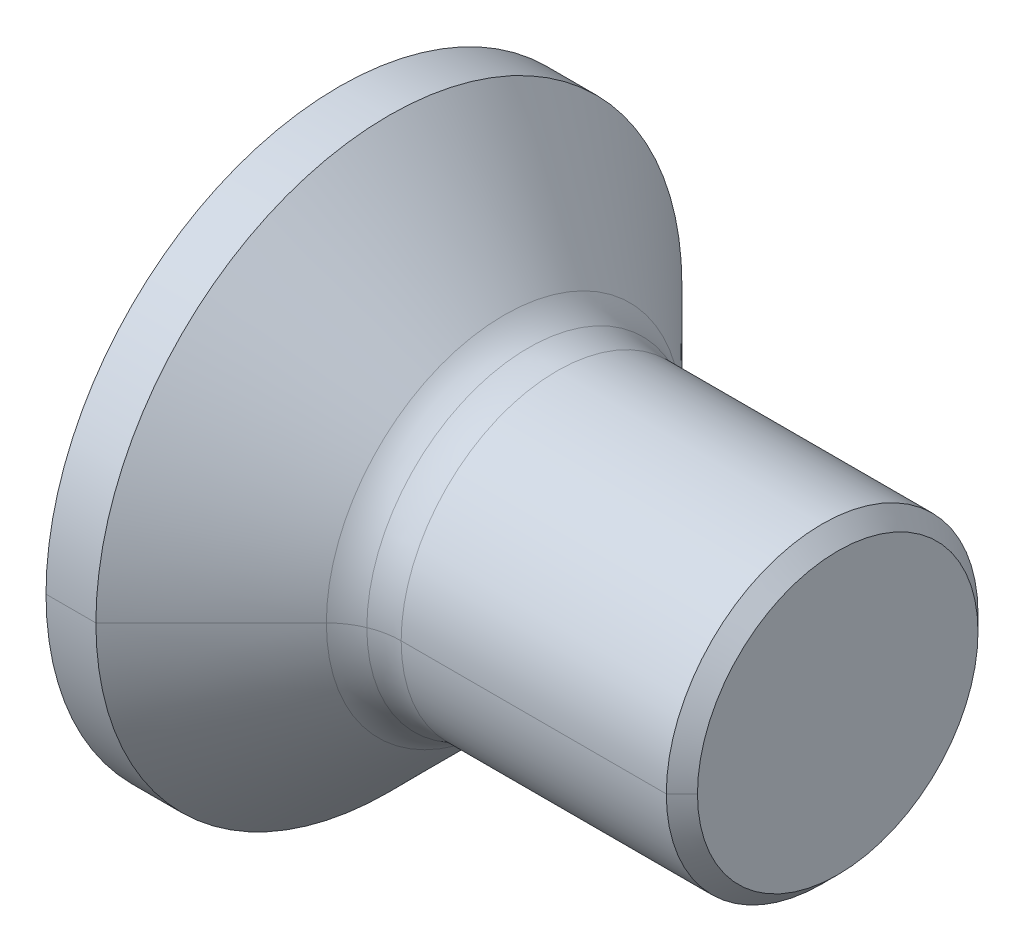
ISO-10303-21;
HEADER;
FILE_DESCRIPTION(('STEP AP214'),'2;1');
FILE_NAME('part.step','',(''),(''),'','','');
FILE_SCHEMA(('AUTOMOTIVE_DESIGN { 1 0 10303 214 1 1 1 1 }'));
ENDSEC;
DATA;
#1=APPLICATION_CONTEXT('core data for automotive mechanical design processes');
#2=APPLICATION_PROTOCOL_DEFINITION('international standard','automotive_design',2000,#1);
#3=PRODUCT_CONTEXT('',#1,'mechanical');
#4=PRODUCT('Part','Part','',(#3));
#5=PRODUCT_RELATED_PRODUCT_CATEGORY('part','',(#4));
#6=PRODUCT_DEFINITION_FORMATION('','',#4);
#7=PRODUCT_DEFINITION_CONTEXT('part definition',#1,'design');
#8=PRODUCT_DEFINITION('design','',#6,#7);
#9=PRODUCT_DEFINITION_SHAPE('','',#8);
#10=(LENGTH_UNIT() NAMED_UNIT(*) SI_UNIT(.MILLI.,.METRE.));
#11=(NAMED_UNIT(*) PLANE_ANGLE_UNIT() SI_UNIT($,.RADIAN.));
#12=(NAMED_UNIT(*) SI_UNIT($,.STERADIAN.) SOLID_ANGLE_UNIT());
#13=UNCERTAINTY_MEASURE_WITH_UNIT(LENGTH_MEASURE(1.E-05),#10,'distance_accuracy_value','');
#14=(GEOMETRIC_REPRESENTATION_CONTEXT(3) GLOBAL_UNCERTAINTY_ASSIGNED_CONTEXT((#13)) GLOBAL_UNIT_ASSIGNED_CONTEXT((#10,
#11,#12)) REPRESENTATION_CONTEXT('',''));
#15=CARTESIAN_POINT('',(0.,0.,0.));
#16=DIRECTION('',(0.,0.,1.));
#17=DIRECTION('',(1.,0.,0.));
#18=AXIS2_PLACEMENT_3D('',#15,#16,#17);
#19=CARTESIAN_POINT('',(0.75,0.37037037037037,1.5));
#20=DIRECTION('',(0.6,0.,0.8));
#21=DIRECTION('',(-0.8,0.,0.6));
#22=AXIS2_PLACEMENT_3D('',#19,#20,#21);
#23=PLANE('',#22);
#24=DIRECTION('',(0.,1.,0.));
#25=VECTOR('',#24,1.);
#26=CARTESIAN_POINT('',(0.75,-0.37037037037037,1.5));
#27=LINE('',#26,#25);
#28=CARTESIAN_POINT('',(0.75,-0.37037037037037,1.5));
#29=VERTEX_POINT('',#28);
#30=CARTESIAN_POINT('',(0.75,0.37037037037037,1.5));
#31=VERTEX_POINT('',#30);
#32=EDGE_CURVE('E20',#29,#31,#27,.T.);
#33=ORIENTED_EDGE('',*,*,#32,.T.);
#34=DIRECTION('',(-0.8,0.,0.6));
#35=VECTOR('',#34,1.);
#36=CARTESIAN_POINT('',(2.25,0.37037037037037,0.375));
#37=LINE('',#36,#35);
#38=CARTESIAN_POINT('',(2.25,0.37037037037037,0.375));
#39=VERTEX_POINT('',#38);
#40=EDGE_CURVE('E430',#39,#31,#37,.T.);
#41=ORIENTED_EDGE('',*,*,#40,.F.);
#42=DIRECTION('',(0.,-1.,0.));
#43=VECTOR('',#42,1.);
#44=CARTESIAN_POINT('',(2.25,0.37037037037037,0.375));
#45=LINE('',#44,#43);
#46=CARTESIAN_POINT('',(2.25,-0.37037037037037,0.375));
#47=VERTEX_POINT('',#46);
#48=EDGE_CURVE('E11',#39,#47,#45,.T.);
#49=ORIENTED_EDGE('',*,*,#48,.T.);
#50=DIRECTION('',(0.8,0.,-0.6));
#51=VECTOR('',#50,1.);
#52=CARTESIAN_POINT('',(0.75,-0.37037037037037,1.5));
#53=LINE('',#52,#51);
#54=EDGE_CURVE('E326',#29,#47,#53,.T.);
#55=ORIENTED_EDGE('',*,*,#54,.F.);
#56=EDGE_LOOP('',(#33,#41,#49,#55));
#57=FACE_BOUND('',#56,.T.);
#58=ADVANCED_FACE('F17',(#57),#23,.F.);
#59=CARTESIAN_POINT('',(2.25,0.37037037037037,0.375));
#60=DIRECTION('',(1.,0.,0.));
#61=DIRECTION('',(0.,0.,1.));
#62=AXIS2_PLACEMENT_3D('',#59,#60,#61);
#63=PLANE('',#62);
#64=ORIENTED_EDGE('',*,*,#48,.F.);
#65=DIRECTION('',(0.,0.,1.));
#66=VECTOR('',#65,1.);
#67=CARTESIAN_POINT('',(2.25,0.37037037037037,-0.375));
#68=LINE('',#67,#66);
#69=CARTESIAN_POINT('',(2.25,0.37037037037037,-0.375));
#70=VERTEX_POINT('',#69);
#71=EDGE_CURVE('E418',#70,#39,#68,.T.);
#72=ORIENTED_EDGE('',*,*,#71,.F.);
#73=DIRECTION('',(0.,-1.,0.));
#74=VECTOR('',#73,1.);
#75=CARTESIAN_POINT('',(2.25,0.37037037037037,-0.375));
#76=LINE('',#75,#74);
#77=CARTESIAN_POINT('',(2.25,-0.37037037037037,-0.375));
#78=VERTEX_POINT('',#77);
#79=EDGE_CURVE('E25',#70,#78,#76,.T.);
#80=ORIENTED_EDGE('',*,*,#79,.T.);
#81=DIRECTION('',(0.,0.,1.));
#82=VECTOR('',#81,1.);
#83=CARTESIAN_POINT('',(2.25,-0.37037037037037,-0.375));
#84=LINE('',#83,#82);
#85=EDGE_CURVE('E324',#78,#47,#84,.T.);
#86=ORIENTED_EDGE('',*,*,#85,.T.);
#87=EDGE_LOOP('',(#64,#72,#80,#86));
#88=FACE_BOUND('',#87,.T.);
#89=ADVANCED_FACE('F415',(#88),#63,.F.);
#90=CARTESIAN_POINT('',(2.25,0.37037037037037,-0.375));
#91=DIRECTION('',(0.6,0.,-0.8));
#92=DIRECTION('',(0.8,0.,0.6));
#93=AXIS2_PLACEMENT_3D('',#90,#91,#92);
#94=PLANE('',#93);
#95=ORIENTED_EDGE('',*,*,#79,.F.);
#96=DIRECTION('',(0.8,0.,0.6));
#97=VECTOR('',#96,1.);
#98=CARTESIAN_POINT('',(0.75,0.37037037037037,-1.5));
#99=LINE('',#98,#97);
#100=CARTESIAN_POINT('',(0.75,0.37037037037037,-1.5));
#101=VERTEX_POINT('',#100);
#102=EDGE_CURVE('E435',#101,#70,#99,.T.);
#103=ORIENTED_EDGE('',*,*,#102,.F.);
#104=DIRECTION('',(0.,1.,0.));
#105=VECTOR('',#104,1.);
#106=CARTESIAN_POINT('',(0.75,-0.37037037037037,-1.5));
#107=LINE('',#106,#105);
#108=CARTESIAN_POINT('',(0.75,-0.37037037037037,-1.5));
#109=VERTEX_POINT('',#108);
#110=EDGE_CURVE('E402',#109,#101,#107,.T.);
#111=ORIENTED_EDGE('',*,*,#110,.F.);
#112=DIRECTION('',(-0.8,0.,-0.6));
#113=VECTOR('',#112,1.);
#114=CARTESIAN_POINT('',(2.25,-0.37037037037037,-0.375));
#115=LINE('',#114,#113);
#116=EDGE_CURVE('E321',#78,#109,#115,.T.);
#117=ORIENTED_EDGE('',*,*,#116,.F.);
#118=EDGE_LOOP('',(#95,#103,#111,#117));
#119=FACE_BOUND('',#118,.T.);
#120=ADVANCED_FACE('F421',(#119),#94,.F.);
#121=CARTESIAN_POINT('',(0.75,0.37037037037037,-1.5));
#122=DIRECTION('',(0.,0.,-1.));
#123=DIRECTION('',(1.,0.,0.));
#124=AXIS2_PLACEMENT_3D('',#121,#122,#123);
#125=PLANE('',#124);
#126=DIRECTION('',(1.,0.,0.));
#127=VECTOR('',#126,1.);
#128=CARTESIAN_POINT('',(0.,-0.37037037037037,-1.5));
#129=LINE('',#128,#127);
#130=CARTESIAN_POINT('',(0.,-0.37037037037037,-1.5));
#131=VERTEX_POINT('',#130);
#132=EDGE_CURVE('E325',#131,#109,#129,.T.);
#133=ORIENTED_EDGE('',*,*,#132,.T.);
#134=ORIENTED_EDGE('',*,*,#110,.T.);
#135=DIRECTION('',(1.,0.,0.));
#136=VECTOR('',#135,1.);
#137=CARTESIAN_POINT('',(0.,0.37037037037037,-1.5));
#138=LINE('',#137,#136);
#139=CARTESIAN_POINT('',(0.,0.37037037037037,-1.5));
#140=VERTEX_POINT('',#139);
#141=EDGE_CURVE('E281',#140,#101,#138,.T.);
#142=ORIENTED_EDGE('',*,*,#141,.F.);
#143=DIRECTION('',(0.,-1.,0.));
#144=VECTOR('',#143,1.);
#145=CARTESIAN_POINT('',(0.,0.37037037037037,-1.5));
#146=LINE('',#145,#144);
#147=EDGE_CURVE('E320',#140,#131,#146,.T.);
#148=ORIENTED_EDGE('',*,*,#147,.T.);
#149=EDGE_LOOP('',(#133,#134,#142,#148));
#150=FACE_BOUND('',#149,.T.);
#151=ADVANCED_FACE('F639',(#150),#125,.F.);
#152=CARTESIAN_POINT('',(0.75,-1.5,0.375));
#153=DIRECTION('',(0.603857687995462,-0.79709214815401,0.));
#154=DIRECTION('',(-0.79709214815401,-0.603857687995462,0.));
#155=AXIS2_PLACEMENT_3D('',#152,#153,#154);
#156=PLANE('',#155);
#157=DIRECTION('',(0.,0.,1.));
#158=VECTOR('',#157,1.);
#159=CARTESIAN_POINT('',(0.75,-1.5,-0.375));
#160=LINE('',#159,#158);
#161=CARTESIAN_POINT('',(0.75,-1.5,-0.375));
#162=VERTEX_POINT('',#161);
#163=CARTESIAN_POINT('',(0.75,-1.5,0.375));
#164=VERTEX_POINT('',#163);
#165=EDGE_CURVE('E396',#162,#164,#160,.T.);
#166=ORIENTED_EDGE('',*,*,#165,.T.);
#167=DIRECTION('',(-0.797092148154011,-0.603857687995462,0.));
#168=VECTOR('',#167,1.);
#169=CARTESIAN_POINT('',(2.235,-0.375,0.375));
#170=LINE('',#169,#168);
#171=CARTESIAN_POINT('',(2.235,-0.375,0.375));
#172=VERTEX_POINT('',#171);
#173=EDGE_CURVE('E376',#172,#164,#170,.T.);
#174=ORIENTED_EDGE('',*,*,#173,.F.);
#175=DIRECTION('',(0.,0.,-1.));
#176=VECTOR('',#175,1.);
#177=CARTESIAN_POINT('',(2.235,-0.375,0.375));
#178=LINE('',#177,#176);
#179=CARTESIAN_POINT('',(2.235,-0.375,-0.375));
#180=VERTEX_POINT('',#179);
#181=EDGE_CURVE('E383',#172,#180,#178,.T.);
#182=ORIENTED_EDGE('',*,*,#181,.T.);
#183=DIRECTION('',(0.797092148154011,0.603857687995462,0.));
#184=VECTOR('',#183,1.);
#185=CARTESIAN_POINT('',(0.75,-1.5,-0.375));
#186=LINE('',#185,#184);
#187=EDGE_CURVE('E356',#162,#180,#186,.T.);
#188=ORIENTED_EDGE('',*,*,#187,.F.);
#189=EDGE_LOOP('',(#166,#174,#182,#188));
#190=FACE_BOUND('',#189,.T.);
#191=ADVANCED_FACE('F644',(#190),#156,.F.);
#192=CARTESIAN_POINT('',(-1.,-1.5,0.375));
#193=DIRECTION('',(0.,-1.,0.));
#194=DIRECTION('',(-1.,0.,0.));
#195=AXIS2_PLACEMENT_3D('',#192,#193,#194);
#196=PLANE('',#195);
#197=DIRECTION('',(-1.,0.,0.));
#198=VECTOR('',#197,1.);
#199=CARTESIAN_POINT('',(0.75,-1.5,0.375));
#200=LINE('',#199,#198);
#201=CARTESIAN_POINT('',(0.,-1.5,0.375));
#202=VERTEX_POINT('',#201);
#203=EDGE_CURVE('E373',#164,#202,#200,.T.);
#204=ORIENTED_EDGE('',*,*,#203,.F.);
#205=ORIENTED_EDGE('',*,*,#165,.F.);
#206=DIRECTION('',(1.,0.,0.));
#207=VECTOR('',#206,1.);
#208=CARTESIAN_POINT('',(0.,-1.5,-0.375));
#209=LINE('',#208,#207);
#210=CARTESIAN_POINT('',(0.,-1.5,-0.375));
#211=VERTEX_POINT('',#210);
#212=EDGE_CURVE('E359',#211,#162,#209,.T.);
#213=ORIENTED_EDGE('',*,*,#212,.F.);
#214=DIRECTION('',(0.,0.,-1.));
#215=VECTOR('',#214,1.);
#216=CARTESIAN_POINT('',(0.,-1.5,0.375));
#217=LINE('',#216,#215);
#218=EDGE_CURVE('E372',#202,#211,#217,.T.);
#219=ORIENTED_EDGE('',*,*,#218,.F.);
#220=EDGE_LOOP('',(#204,#205,#213,#219));
#221=FACE_BOUND('',#220,.T.);
#222=ADVANCED_FACE('F648',(#221),#196,.F.);
#223=CARTESIAN_POINT('',(0.,-1.06066017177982,1.06066017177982));
#224=DIRECTION('',(0.,0.642787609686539,0.766044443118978));
#225=DIRECTION('',(0.,-0.766044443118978,0.642787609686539));
#226=AXIS2_PLACEMENT_3D('',#223,#224,#225);
#227=PLANE('',#226);
#228=DIRECTION('',(0.,0.766044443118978,-0.642787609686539));
#229=VECTOR('',#228,1.);
#230=CARTESIAN_POINT('',(1.,-1.06066017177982,1.06066017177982));
#231=LINE('',#230,#229);
#232=CARTESIAN_POINT('',(1.,-1.06066017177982,1.06066017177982));
#233=VERTEX_POINT('',#232);
#234=CARTESIAN_POINT('',(1.,-0.37037037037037,0.481438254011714));
#235=VERTEX_POINT('',#234);
#236=EDGE_CURVE('E390',#233,#235,#231,.T.);
#237=ORIENTED_EDGE('',*,*,#236,.F.);
#238=DIRECTION('',(1.,0.,0.));
#239=VECTOR('',#238,1.);
#240=CARTESIAN_POINT('',(0.,-1.06066017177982,1.06066017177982));
#241=LINE('',#240,#239);
#242=CARTESIAN_POINT('',(0.,-1.06066017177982,1.06066017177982));
#243=VERTEX_POINT('',#242);
#244=EDGE_CURVE('E387',#243,#233,#241,.T.);
#245=ORIENTED_EDGE('',*,*,#244,.F.);
#246=DIRECTION('',(0.,-0.766044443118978,0.642787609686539));
#247=VECTOR('',#246,1.);
#248=CARTESIAN_POINT('',(0.,-0.370370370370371,0.481438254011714));
#249=LINE('',#248,#247);
#250=CARTESIAN_POINT('',(0.,-0.37037037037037,0.481438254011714));
#251=VERTEX_POINT('',#250);
#252=EDGE_CURVE('E331',#251,#243,#249,.T.);
#253=ORIENTED_EDGE('',*,*,#252,.F.);
#254=DIRECTION('',(1.,0.,0.));
#255=VECTOR('',#254,1.);
#256=CARTESIAN_POINT('',(0.,-0.37037037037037,0.481438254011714));
#257=LINE('',#256,#255);
#258=EDGE_CURVE('E329',#251,#235,#257,.T.);
#259=ORIENTED_EDGE('',*,*,#258,.T.);
#260=EDGE_LOOP('',(#237,#245,#253,#259));
#261=FACE_BOUND('',#260,.T.);
#262=ADVANCED_FACE('F606',(#261),#227,.F.);
#263=CARTESIAN_POINT('',(1.,0.,0.));
#264=DIRECTION('',(-1.,0.,0.));
#265=DIRECTION('',(0.,0.,1.));
#266=AXIS2_PLACEMENT_3D('',#263,#264,#265);
#267=PLANE('',#266);
#268=DIRECTION('',(0.,-0.642787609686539,0.766044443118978));
#269=VECTOR('',#268,1.);
#270=CARTESIAN_POINT('',(1.,-0.485322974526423,0.375));
#271=LINE('',#270,#269);
#272=CARTESIAN_POINT('',(1.,-0.485322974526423,0.375));
#273=VERTEX_POINT('',#272);
#274=EDGE_CURVE('E391',#273,#233,#271,.T.);
#275=ORIENTED_EDGE('',*,*,#274,.T.);
#276=ORIENTED_EDGE('',*,*,#236,.T.);
#277=DIRECTION('',(0.,0.,-1.));
#278=VECTOR('',#277,1.);
#279=CARTESIAN_POINT('',(1.,-0.37037037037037,0.481438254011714));
#280=LINE('',#279,#278);
#281=CARTESIAN_POINT('',(1.,-0.37037037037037,0.375));
#282=VERTEX_POINT('',#281);
#283=EDGE_CURVE('E385',#235,#282,#280,.T.);
#284=ORIENTED_EDGE('',*,*,#283,.T.);
#285=DIRECTION('',(0.,-1.,0.));
#286=VECTOR('',#285,1.);
#287=CARTESIAN_POINT('',(1.,-0.37037037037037,0.375));
#288=LINE('',#287,#286);
#289=EDGE_CURVE('E380',#282,#273,#288,.T.);
#290=ORIENTED_EDGE('',*,*,#289,.T.);
#291=EDGE_LOOP('',(#275,#276,#284,#290));
#292=FACE_BOUND('',#291,.T.);
#293=ADVANCED_FACE('F611',(#292),#267,.T.);
#294=CARTESIAN_POINT('',(0.,-0.170660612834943,0.));
#295=DIRECTION('',(0.,-0.766044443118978,-0.642787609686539));
#296=DIRECTION('',(0.,0.642787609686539,-0.766044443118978));
#297=AXIS2_PLACEMENT_3D('',#294,#295,#296);
#298=PLANE('',#297);
#299=DIRECTION('',(0.,0.642787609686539,-0.766044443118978));
#300=VECTOR('',#299,1.);
#301=CARTESIAN_POINT('',(0.,-1.06066017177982,1.06066017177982));
#302=LINE('',#301,#300);
#303=CARTESIAN_POINT('',(0.,-0.485322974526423,0.375));
#304=VERTEX_POINT('',#303);
#305=EDGE_CURVE('E371',#243,#304,#302,.T.);
#306=ORIENTED_EDGE('',*,*,#305,.F.);
#307=ORIENTED_EDGE('',*,*,#244,.T.);
#308=ORIENTED_EDGE('',*,*,#274,.F.);
#309=DIRECTION('',(-1.,0.,0.));
#310=VECTOR('',#309,1.);
#311=CARTESIAN_POINT('',(1.,-0.485322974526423,0.375));
#312=LINE('',#311,#310);
#313=EDGE_CURVE('E377',#273,#304,#312,.T.);
#314=ORIENTED_EDGE('',*,*,#313,.T.);
#315=EDGE_LOOP('',(#306,#307,#308,#314));
#316=FACE_BOUND('',#315,.T.);
#317=ADVANCED_FACE('F618',(#316),#298,.F.);
#318=CARTESIAN_POINT('',(0.,0.,0.375));
#319=DIRECTION('',(0.,0.,1.));
#320=DIRECTION('',(1.,0.,0.));
#321=AXIS2_PLACEMENT_3D('',#318,#319,#320);
#322=PLANE('',#321);
#323=ORIENTED_EDGE('',*,*,#289,.F.);
#324=DIRECTION('',(1.,0.,0.));
#325=VECTOR('',#324,1.);
#326=CARTESIAN_POINT('',(1.,-0.37037037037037,0.375));
#327=LINE('',#326,#325);
#328=CARTESIAN_POINT('',(2.235,-0.37037037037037,0.375));
#329=VERTEX_POINT('',#328);
#330=EDGE_CURVE('E336',#282,#329,#327,.T.);
#331=ORIENTED_EDGE('',*,*,#330,.T.);
#332=DIRECTION('',(0.,-1.,0.));
#333=VECTOR('',#332,1.);
#334=CARTESIAN_POINT('',(2.235,-0.37037037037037,0.375));
#335=LINE('',#334,#333);
#336=EDGE_CURVE('E366',#329,#172,#335,.T.);
#337=ORIENTED_EDGE('',*,*,#336,.T.);
#338=ORIENTED_EDGE('',*,*,#173,.T.);
#339=ORIENTED_EDGE('',*,*,#203,.T.);
#340=DIRECTION('',(0.,1.,0.));
#341=VECTOR('',#340,1.);
#342=CARTESIAN_POINT('',(0.,-1.5,0.375));
#343=LINE('',#342,#341);
#344=EDGE_CURVE('E368',#202,#304,#343,.T.);
#345=ORIENTED_EDGE('',*,*,#344,.T.);
#346=ORIENTED_EDGE('',*,*,#313,.F.);
#347=EDGE_LOOP('',(#323,#331,#337,#338,#339,#345,#346));
#348=FACE_BOUND('',#347,.T.);
#349=ADVANCED_FACE('F615',(#348),#322,.F.);
#350=CARTESIAN_POINT('',(2.235,-0.375,0.375));
#351=DIRECTION('',(1.,0.,0.));
#352=DIRECTION('',(0.,-1.,0.));
#353=AXIS2_PLACEMENT_3D('',#350,#351,#352);
#354=PLANE('',#353);
#355=DIRECTION('',(0.,1.,0.));
#356=VECTOR('',#355,1.);
#357=CARTESIAN_POINT('',(2.235,-0.375,-0.375));
#358=LINE('',#357,#356);
#359=CARTESIAN_POINT('',(2.235,-0.37037037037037,-0.375));
#360=VERTEX_POINT('',#359);
#361=EDGE_CURVE('E353',#180,#360,#358,.T.);
#362=ORIENTED_EDGE('',*,*,#361,.F.);
#363=ORIENTED_EDGE('',*,*,#181,.F.);
#364=ORIENTED_EDGE('',*,*,#336,.F.);
#365=DIRECTION('',(0.,0.,1.));
#366=VECTOR('',#365,1.);
#367=CARTESIAN_POINT('',(2.235,-0.37037037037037,-0.375));
#368=LINE('',#367,#366);
#369=EDGE_CURVE('E332',#360,#329,#368,.T.);
#370=ORIENTED_EDGE('',*,*,#369,.F.);
#371=EDGE_LOOP('',(#362,#363,#364,#370));
#372=FACE_BOUND('',#371,.T.);
#373=ADVANCED_FACE('F626',(#372),#354,.F.);
#374=CARTESIAN_POINT('',(0.,0.,-0.170660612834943));
#375=DIRECTION('',(0.,0.642787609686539,-0.766044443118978));
#376=DIRECTION('',(0.,0.766044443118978,0.642787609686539));
#377=AXIS2_PLACEMENT_3D('',#374,#375,#376);
#378=PLANE('',#377);
#379=DIRECTION('',(0.,0.766044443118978,0.642787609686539));
#380=VECTOR('',#379,1.);
#381=CARTESIAN_POINT('',(0.,-1.06066017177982,-1.06066017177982));
#382=LINE('',#381,#380);
#383=CARTESIAN_POINT('',(0.,-1.06066017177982,-1.06066017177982));
#384=VERTEX_POINT('',#383);
#385=CARTESIAN_POINT('',(0.,-0.37037037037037,-0.481438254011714));
#386=VERTEX_POINT('',#385);
#387=EDGE_CURVE('E319',#384,#386,#382,.T.);
#388=ORIENTED_EDGE('',*,*,#387,.F.);
#389=DIRECTION('',(-1.,0.,0.));
#390=VECTOR('',#389,1.);
#391=CARTESIAN_POINT('',(1.,-1.06066017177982,-1.06066017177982));
#392=LINE('',#391,#390);
#393=CARTESIAN_POINT('',(1.,-1.06066017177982,-1.06066017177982));
#394=VERTEX_POINT('',#393);
#395=EDGE_CURVE('E362',#394,#384,#392,.T.);
#396=ORIENTED_EDGE('',*,*,#395,.F.);
#397=DIRECTION('',(0.,-0.766044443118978,-0.642787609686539));
#398=VECTOR('',#397,1.);
#399=CARTESIAN_POINT('',(1.,-0.37037037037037,-0.481438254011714));
#400=LINE('',#399,#398);
#401=CARTESIAN_POINT('',(1.,-0.37037037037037,-0.481438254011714));
#402=VERTEX_POINT('',#401);
#403=EDGE_CURVE('E345',#402,#394,#400,.T.);
#404=ORIENTED_EDGE('',*,*,#403,.F.);
#405=DIRECTION('',(-1.,0.,0.));
#406=VECTOR('',#405,1.);
#407=CARTESIAN_POINT('',(1.,-0.37037037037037,-0.481438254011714));
#408=LINE('',#407,#406);
#409=EDGE_CURVE('E352',#402,#386,#408,.T.);
#410=ORIENTED_EDGE('',*,*,#409,.T.);
#411=EDGE_LOOP('',(#388,#396,#404,#410));
#412=FACE_BOUND('',#411,.T.);
#413=ADVANCED_FACE('F669',(#412),#378,.F.);
#414=CARTESIAN_POINT('',(0.,-1.06066017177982,-1.06066017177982));
#415=DIRECTION('',(0.,-0.766044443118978,0.642787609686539));
#416=DIRECTION('',(0.,-0.642787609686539,-0.766044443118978));
#417=AXIS2_PLACEMENT_3D('',#414,#415,#416);
#418=PLANE('',#417);
#419=DIRECTION('',(0.,0.642787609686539,0.766044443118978));
#420=VECTOR('',#419,1.);
#421=CARTESIAN_POINT('',(1.,-1.06066017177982,-1.06066017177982));
#422=LINE('',#421,#420);
#423=CARTESIAN_POINT('',(1.,-0.485322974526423,-0.375));
#424=VERTEX_POINT('',#423);
#425=EDGE_CURVE('E342',#394,#424,#422,.T.);
#426=ORIENTED_EDGE('',*,*,#425,.F.);
#427=ORIENTED_EDGE('',*,*,#395,.T.);
#428=DIRECTION('',(0.,-0.642787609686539,-0.766044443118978));
#429=VECTOR('',#428,1.);
#430=CARTESIAN_POINT('',(0.,-0.485322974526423,-0.375));
#431=LINE('',#430,#429);
#432=CARTESIAN_POINT('',(0.,-0.485322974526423,-0.375));
#433=VERTEX_POINT('',#432);
#434=EDGE_CURVE('E593',#433,#384,#431,.T.);
#435=ORIENTED_EDGE('',*,*,#434,.F.);
#436=DIRECTION('',(1.,0.,0.));
#437=VECTOR('',#436,1.);
#438=CARTESIAN_POINT('',(0.,-0.485322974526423,-0.375));
#439=LINE('',#438,#437);
#440=EDGE_CURVE('E348',#433,#424,#439,.T.);
#441=ORIENTED_EDGE('',*,*,#440,.T.);
#442=EDGE_LOOP('',(#426,#427,#435,#441));
#443=FACE_BOUND('',#442,.T.);
#444=ADVANCED_FACE('F677',(#443),#418,.F.);
#445=CARTESIAN_POINT('',(0.,0.,-0.375));
#446=DIRECTION('',(0.,0.,1.));
#447=DIRECTION('',(1.,0.,0.));
#448=AXIS2_PLACEMENT_3D('',#445,#446,#447);
#449=PLANE('',#448);
#450=DIRECTION('',(0.,1.,0.));
#451=VECTOR('',#450,1.);
#452=CARTESIAN_POINT('',(0.,-1.5,-0.375));
#453=LINE('',#452,#451);
#454=EDGE_CURVE('E596',#211,#433,#453,.T.);
#455=ORIENTED_EDGE('',*,*,#454,.F.);
#456=ORIENTED_EDGE('',*,*,#212,.T.);
#457=ORIENTED_EDGE('',*,*,#187,.T.);
#458=ORIENTED_EDGE('',*,*,#361,.T.);
#459=DIRECTION('',(1.,0.,0.));
#460=VECTOR('',#459,1.);
#461=CARTESIAN_POINT('',(1.,-0.37037037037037,-0.375));
#462=LINE('',#461,#460);
#463=CARTESIAN_POINT('',(1.,-0.37037037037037,-0.375));
#464=VERTEX_POINT('',#463);
#465=EDGE_CURVE('E335',#464,#360,#462,.T.);
#466=ORIENTED_EDGE('',*,*,#465,.F.);
#467=DIRECTION('',(0.,1.,0.));
#468=VECTOR('',#467,1.);
#469=CARTESIAN_POINT('',(1.,-0.485322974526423,-0.375));
#470=LINE('',#469,#468);
#471=EDGE_CURVE('E339',#424,#464,#470,.T.);
#472=ORIENTED_EDGE('',*,*,#471,.F.);
#473=ORIENTED_EDGE('',*,*,#440,.F.);
#474=EDGE_LOOP('',(#455,#456,#457,#458,#466,#472,#473));
#475=FACE_BOUND('',#474,.T.);
#476=ADVANCED_FACE('F685',(#475),#449,.T.);
#477=CARTESIAN_POINT('',(1.,0.,0.));
#478=DIRECTION('',(-1.,0.,0.));
#479=DIRECTION('',(0.,0.,1.));
#480=AXIS2_PLACEMENT_3D('',#477,#478,#479);
#481=PLANE('',#480);
#482=DIRECTION('',(0.,0.,-1.));
#483=VECTOR('',#482,1.);
#484=CARTESIAN_POINT('',(1.,-0.37037037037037,-0.375));
#485=LINE('',#484,#483);
#486=EDGE_CURVE('E349',#464,#402,#485,.T.);
#487=ORIENTED_EDGE('',*,*,#486,.T.);
#488=ORIENTED_EDGE('',*,*,#403,.T.);
#489=ORIENTED_EDGE('',*,*,#425,.T.);
#490=ORIENTED_EDGE('',*,*,#471,.T.);
#491=EDGE_LOOP('',(#487,#488,#489,#490));
#492=FACE_BOUND('',#491,.T.);
#493=ADVANCED_FACE('F693',(#492),#481,.T.);
#494=CARTESIAN_POINT('',(0.,-0.37037037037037,0.));
#495=DIRECTION('',(0.,1.,0.));
#496=DIRECTION('',(0.,0.,1.));
#497=AXIS2_PLACEMENT_3D('',#494,#495,#496);
#498=PLANE('',#497);
#499=ORIENTED_EDGE('',*,*,#465,.T.);
#500=ORIENTED_EDGE('',*,*,#369,.T.);
#501=ORIENTED_EDGE('',*,*,#330,.F.);
#502=ORIENTED_EDGE('',*,*,#283,.F.);
#503=ORIENTED_EDGE('',*,*,#258,.F.);
#504=DIRECTION('',(0.,0.,1.));
#505=VECTOR('',#504,1.);
#506=CARTESIAN_POINT('',(0.,-0.37037037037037,0.481438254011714));
#507=LINE('',#506,#505);
#508=CARTESIAN_POINT('',(0.,-0.37037037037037,1.5));
#509=VERTEX_POINT('',#508);
#510=EDGE_CURVE('E313',#251,#509,#507,.T.);
#511=ORIENTED_EDGE('',*,*,#510,.T.);
#512=DIRECTION('',(-1.,0.,0.));
#513=VECTOR('',#512,1.);
#514=CARTESIAN_POINT('',(0.75,-0.37037037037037,1.5));
#515=LINE('',#514,#513);
#516=EDGE_CURVE('E307',#29,#509,#515,.T.);
#517=ORIENTED_EDGE('',*,*,#516,.F.);
#518=ORIENTED_EDGE('',*,*,#54,.T.);
#519=ORIENTED_EDGE('',*,*,#85,.F.);
#520=ORIENTED_EDGE('',*,*,#116,.T.);
#521=ORIENTED_EDGE('',*,*,#132,.F.);
#522=DIRECTION('',(0.,0.,1.));
#523=VECTOR('',#522,1.);
#524=CARTESIAN_POINT('',(0.,-0.37037037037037,-1.5));
#525=LINE('',#524,#523);
#526=EDGE_CURVE('E316',#131,#386,#525,.T.);
#527=ORIENTED_EDGE('',*,*,#526,.T.);
#528=ORIENTED_EDGE('',*,*,#409,.F.);
#529=ORIENTED_EDGE('',*,*,#486,.F.);
#530=EDGE_LOOP('',(#499,#500,#501,#502,#503,#511,#517,#518,#519,#520,#521,#527,#528,#529));
#531=FACE_BOUND('',#530,.T.);
#532=ADVANCED_FACE('F424',(#531),#498,.T.);
#533=CARTESIAN_POINT('',(-1.,0.37037037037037,1.5));
#534=DIRECTION('',(0.,0.,1.));
#535=DIRECTION('',(-1.,0.,0.));
#536=AXIS2_PLACEMENT_3D('',#533,#534,#535);
#537=PLANE('',#536);
#538=DIRECTION('',(-1.,0.,0.));
#539=VECTOR('',#538,1.);
#540=CARTESIAN_POINT('',(0.75,0.37037037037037,1.5));
#541=LINE('',#540,#539);
#542=CARTESIAN_POINT('',(0.,0.37037037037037,1.5));
#543=VERTEX_POINT('',#542);
#544=EDGE_CURVE('E301',#31,#543,#541,.T.);
#545=ORIENTED_EDGE('',*,*,#544,.F.);
#546=ORIENTED_EDGE('',*,*,#32,.F.);
#547=ORIENTED_EDGE('',*,*,#516,.T.);
#548=DIRECTION('',(0.,1.,0.));
#549=VECTOR('',#548,1.);
#550=CARTESIAN_POINT('',(0.,-0.37037037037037,1.5));
#551=LINE('',#550,#549);
#552=EDGE_CURVE('E310',#509,#543,#551,.T.);
#553=ORIENTED_EDGE('',*,*,#552,.T.);
#554=EDGE_LOOP('',(#545,#546,#547,#553));
#555=FACE_BOUND('',#554,.T.);
#556=ADVANCED_FACE('F708',(#555),#537,.F.);
#557=CARTESIAN_POINT('',(1.,0.,0.));
#558=DIRECTION('',(-1.,0.,0.));
#559=DIRECTION('',(0.,0.,1.));
#560=AXIS2_PLACEMENT_3D('',#557,#558,#559);
#561=PLANE('',#560);
#562=DIRECTION('',(0.,0.,1.));
#563=VECTOR('',#562,1.);
#564=CARTESIAN_POINT('',(1.,0.37037037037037,0.375));
#565=LINE('',#564,#563);
#566=CARTESIAN_POINT('',(1.,0.37037037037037,0.375));
#567=VERTEX_POINT('',#566);
#568=CARTESIAN_POINT('',(1.,0.37037037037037,0.481438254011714));
#569=VERTEX_POINT('',#568);
#570=EDGE_CURVE('E302',#567,#569,#565,.T.);
#571=ORIENTED_EDGE('',*,*,#570,.T.);
#572=DIRECTION('',(0.,0.766044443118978,0.642787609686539));
#573=VECTOR('',#572,1.);
#574=CARTESIAN_POINT('',(1.,0.37037037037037,0.481438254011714));
#575=LINE('',#574,#573);
#576=CARTESIAN_POINT('',(1.,1.06066017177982,1.06066017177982));
#577=VERTEX_POINT('',#576);
#578=EDGE_CURVE('E305',#569,#577,#575,.T.);
#579=ORIENTED_EDGE('',*,*,#578,.T.);
#580=DIRECTION('',(0.,-0.642787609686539,-0.766044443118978));
#581=VECTOR('',#580,1.);
#582=CARTESIAN_POINT('',(1.,1.06066017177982,1.06066017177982));
#583=LINE('',#582,#581);
#584=CARTESIAN_POINT('',(1.,0.485322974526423,0.375));
#585=VERTEX_POINT('',#584);
#586=EDGE_CURVE('E298',#577,#585,#583,.T.);
#587=ORIENTED_EDGE('',*,*,#586,.T.);
#588=DIRECTION('',(0.,-1.,0.));
#589=VECTOR('',#588,1.);
#590=CARTESIAN_POINT('',(1.,0.485322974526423,0.375));
#591=LINE('',#590,#589);
#592=EDGE_CURVE('E294',#585,#567,#591,.T.);
#593=ORIENTED_EDGE('',*,*,#592,.T.);
#594=EDGE_LOOP('',(#571,#579,#587,#593));
#595=FACE_BOUND('',#594,.T.);
#596=ADVANCED_FACE('F715',(#595),#561,.T.);
#597=CARTESIAN_POINT('',(0.,0.,0.170660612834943));
#598=DIRECTION('',(0.,-0.642787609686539,0.766044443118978));
#599=DIRECTION('',(0.,-0.766044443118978,-0.642787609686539));
#600=AXIS2_PLACEMENT_3D('',#597,#598,#599);
#601=PLANE('',#600);
#602=DIRECTION('',(0.,-0.766044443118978,-0.642787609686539));
#603=VECTOR('',#602,1.);
#604=CARTESIAN_POINT('',(0.,1.06066017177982,1.06066017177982));
#605=LINE('',#604,#603);
#606=CARTESIAN_POINT('',(0.,1.06066017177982,1.06066017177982));
#607=VERTEX_POINT('',#606);
#608=CARTESIAN_POINT('',(0.,0.37037037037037,0.481438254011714));
#609=VERTEX_POINT('',#608);
#610=EDGE_CURVE('E461',#607,#609,#605,.T.);
#611=ORIENTED_EDGE('',*,*,#610,.F.);
#612=DIRECTION('',(-1.,0.,0.));
#613=VECTOR('',#612,1.);
#614=CARTESIAN_POINT('',(1.,1.06066017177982,1.06066017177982));
#615=LINE('',#614,#613);
#616=EDGE_CURVE('E295',#577,#607,#615,.T.);
#617=ORIENTED_EDGE('',*,*,#616,.F.);
#618=ORIENTED_EDGE('',*,*,#578,.F.);
#619=DIRECTION('',(-1.,0.,0.));
#620=VECTOR('',#619,1.);
#621=CARTESIAN_POINT('',(1.,0.370370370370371,0.481438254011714));
#622=LINE('',#621,#620);
#623=EDGE_CURVE('E299',#569,#609,#622,.T.);
#624=ORIENTED_EDGE('',*,*,#623,.T.);
#625=EDGE_LOOP('',(#611,#617,#618,#624));
#626=FACE_BOUND('',#625,.T.);
#627=ADVANCED_FACE('F722',(#626),#601,.F.);
#628=CARTESIAN_POINT('',(0.,1.06066017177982,1.06066017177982));
#629=DIRECTION('',(0.,0.766044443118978,-0.642787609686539));
#630=DIRECTION('',(0.,0.642787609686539,0.766044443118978));
#631=AXIS2_PLACEMENT_3D('',#628,#629,#630);
#632=PLANE('',#631);
#633=ORIENTED_EDGE('',*,*,#586,.F.);
#634=ORIENTED_EDGE('',*,*,#616,.T.);
#635=DIRECTION('',(0.,0.642787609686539,0.766044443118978));
#636=VECTOR('',#635,1.);
#637=CARTESIAN_POINT('',(0.,0.485322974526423,0.375));
#638=LINE('',#637,#636);
#639=CARTESIAN_POINT('',(0.,0.485322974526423,0.375));
#640=VERTEX_POINT('',#639);
#641=EDGE_CURVE('E473',#640,#607,#638,.T.);
#642=ORIENTED_EDGE('',*,*,#641,.F.);
#643=DIRECTION('',(1.,0.,0.));
#644=VECTOR('',#643,1.);
#645=CARTESIAN_POINT('',(0.,0.485322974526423,0.375));
#646=LINE('',#645,#644);
#647=EDGE_CURVE('E291',#640,#585,#646,.T.);
#648=ORIENTED_EDGE('',*,*,#647,.T.);
#649=EDGE_LOOP('',(#633,#634,#642,#648));
#650=FACE_BOUND('',#649,.T.);
#651=ADVANCED_FACE('F730',(#650),#632,.F.);
#652=CARTESIAN_POINT('',(0.,0.,0.375));
#653=DIRECTION('',(0.,0.,1.));
#654=DIRECTION('',(1.,0.,0.));
#655=AXIS2_PLACEMENT_3D('',#652,#653,#654);
#656=PLANE('',#655);
#657=DIRECTION('',(0.,-1.,0.));
#658=VECTOR('',#657,1.);
#659=CARTESIAN_POINT('',(0.,1.5,0.375));
#660=LINE('',#659,#658);
#661=CARTESIAN_POINT('',(0.,1.5,0.375));
#662=VERTEX_POINT('',#661);
#663=EDGE_CURVE('E477',#662,#640,#660,.T.);
#664=ORIENTED_EDGE('',*,*,#663,.F.);
#665=DIRECTION('',(1.,0.,0.));
#666=VECTOR('',#665,1.);
#667=CARTESIAN_POINT('',(0.,1.5,0.375));
#668=LINE('',#667,#666);
#669=CARTESIAN_POINT('',(0.75,1.5,0.375));
#670=VERTEX_POINT('',#669);
#671=EDGE_CURVE('E289',#662,#670,#668,.T.);
#672=ORIENTED_EDGE('',*,*,#671,.T.);
#673=DIRECTION('',(0.79709214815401,-0.603857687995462,0.));
#674=VECTOR('',#673,1.);
#675=CARTESIAN_POINT('',(0.75,1.5,0.375));
#676=LINE('',#675,#674);
#677=CARTESIAN_POINT('',(2.235,0.375,0.375));
#678=VERTEX_POINT('',#677);
#679=EDGE_CURVE('E287',#670,#678,#676,.T.);
#680=ORIENTED_EDGE('',*,*,#679,.T.);
#681=DIRECTION('',(0.,1.,0.));
#682=VECTOR('',#681,1.);
#683=CARTESIAN_POINT('',(2.235,0.370370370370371,0.375));
#684=LINE('',#683,#682);
#685=CARTESIAN_POINT('',(2.235,0.37037037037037,0.375));
#686=VERTEX_POINT('',#685);
#687=EDGE_CURVE('E280',#686,#678,#684,.T.);
#688=ORIENTED_EDGE('',*,*,#687,.F.);
#689=DIRECTION('',(1.,0.,0.));
#690=VECTOR('',#689,1.);
#691=CARTESIAN_POINT('',(1.,0.37037037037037,0.375));
#692=LINE('',#691,#690);
#693=EDGE_CURVE('E309',#567,#686,#692,.T.);
#694=ORIENTED_EDGE('',*,*,#693,.F.);
#695=ORIENTED_EDGE('',*,*,#592,.F.);
#696=ORIENTED_EDGE('',*,*,#647,.F.);
#697=EDGE_LOOP('',(#664,#672,#680,#688,#694,#695,#696));
#698=FACE_BOUND('',#697,.T.);
#699=ADVANCED_FACE('F737',(#698),#656,.F.);
#700=CARTESIAN_POINT('',(0.75,1.5,0.375));
#701=DIRECTION('',(0.,1.,0.));
#702=DIRECTION('',(1.,0.,0.));
#703=AXIS2_PLACEMENT_3D('',#700,#701,#702);
#704=PLANE('',#703);
#705=DIRECTION('',(-1.,0.,0.));
#706=VECTOR('',#705,1.);
#707=CARTESIAN_POINT('',(0.75,1.5,-0.375));
#708=LINE('',#707,#706);
#709=CARTESIAN_POINT('',(0.75,1.5,-0.375));
#710=VERTEX_POINT('',#709);
#711=CARTESIAN_POINT('',(0.,1.5,-0.375));
#712=VERTEX_POINT('',#711);
#713=EDGE_CURVE('E899',#710,#712,#708,.T.);
#714=ORIENTED_EDGE('',*,*,#713,.F.);
#715=DIRECTION('',(0.,0.,1.));
#716=VECTOR('',#715,1.);
#717=CARTESIAN_POINT('',(0.75,1.5,-0.375));
#718=LINE('',#717,#716);
#719=EDGE_CURVE('E284',#710,#670,#718,.T.);
#720=ORIENTED_EDGE('',*,*,#719,.T.);
#721=ORIENTED_EDGE('',*,*,#671,.F.);
#722=DIRECTION('',(0.,0.,1.));
#723=VECTOR('',#722,1.);
#724=CARTESIAN_POINT('',(0.,1.5,-0.375));
#725=LINE('',#724,#723);
#726=EDGE_CURVE('E483',#712,#662,#725,.T.);
#727=ORIENTED_EDGE('',*,*,#726,.F.);
#728=EDGE_LOOP('',(#714,#720,#721,#727));
#729=FACE_BOUND('',#728,.T.);
#730=ADVANCED_FACE('F745',(#729),#704,.F.);
#731=CARTESIAN_POINT('',(2.235,0.375,0.375));
#732=DIRECTION('',(0.603857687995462,0.79709214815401,0.));
#733=DIRECTION('',(0.79709214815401,-0.603857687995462,0.));
#734=AXIS2_PLACEMENT_3D('',#731,#732,#733);
#735=PLANE('',#734);
#736=DIRECTION('',(0.,0.,-1.));
#737=VECTOR('',#736,1.);
#738=CARTESIAN_POINT('',(2.235,0.375,0.375));
#739=LINE('',#738,#737);
#740=CARTESIAN_POINT('',(2.235,0.375,-0.375));
#741=VERTEX_POINT('',#740);
#742=EDGE_CURVE('E277',#678,#741,#739,.T.);
#743=ORIENTED_EDGE('',*,*,#742,.F.);
#744=ORIENTED_EDGE('',*,*,#679,.F.);
#745=ORIENTED_EDGE('',*,*,#719,.F.);
#746=DIRECTION('',(-0.79709214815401,0.603857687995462,0.));
#747=VECTOR('',#746,1.);
#748=CARTESIAN_POINT('',(2.235,0.375,-0.375));
#749=LINE('',#748,#747);
#750=EDGE_CURVE('E894',#741,#710,#749,.T.);
#751=ORIENTED_EDGE('',*,*,#750,.F.);
#752=EDGE_LOOP('',(#743,#744,#745,#751));
#753=FACE_BOUND('',#752,.T.);
#754=ADVANCED_FACE('F753',(#753),#735,.F.);
#755=CARTESIAN_POINT('',(2.235,-0.375,0.375));
#756=DIRECTION('',(1.,0.,0.));
#757=DIRECTION('',(0.,-1.,0.));
#758=AXIS2_PLACEMENT_3D('',#755,#756,#757);
#759=PLANE('',#758);
#760=ORIENTED_EDGE('',*,*,#687,.T.);
#761=ORIENTED_EDGE('',*,*,#742,.T.);
#762=DIRECTION('',(0.,1.,0.));
#763=VECTOR('',#762,1.);
#764=CARTESIAN_POINT('',(2.235,0.37037037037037,-0.375));
#765=LINE('',#764,#763);
#766=CARTESIAN_POINT('',(2.235,0.37037037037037,-0.375));
#767=VERTEX_POINT('',#766);
#768=EDGE_CURVE('E893',#767,#741,#765,.T.);
#769=ORIENTED_EDGE('',*,*,#768,.F.);
#770=DIRECTION('',(0.,0.,-1.));
#771=VECTOR('',#770,1.);
#772=CARTESIAN_POINT('',(2.235,0.37037037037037,0.375));
#773=LINE('',#772,#771);
#774=EDGE_CURVE('E444',#686,#767,#773,.T.);
#775=ORIENTED_EDGE('',*,*,#774,.F.);
#776=EDGE_LOOP('',(#760,#761,#769,#775));
#777=FACE_BOUND('',#776,.T.);
#778=ADVANCED_FACE('F761',(#777),#759,.F.);
#779=CARTESIAN_POINT('',(1.,0.,0.));
#780=DIRECTION('',(-1.,0.,0.));
#781=DIRECTION('',(0.,0.,1.));
#782=AXIS2_PLACEMENT_3D('',#779,#780,#781);
#783=PLANE('',#782);
#784=DIRECTION('',(0.,0.642787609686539,-0.766044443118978));
#785=VECTOR('',#784,1.);
#786=CARTESIAN_POINT('',(1.,0.485322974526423,-0.375));
#787=LINE('',#786,#785);
#788=CARTESIAN_POINT('',(1.,0.485322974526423,-0.375));
#789=VERTEX_POINT('',#788);
#790=CARTESIAN_POINT('',(1.,1.06066017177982,-1.06066017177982));
#791=VERTEX_POINT('',#790);
#792=EDGE_CURVE('E247',#789,#791,#787,.T.);
#793=ORIENTED_EDGE('',*,*,#792,.T.);
#794=DIRECTION('',(0.,-0.766044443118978,0.642787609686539));
#795=VECTOR('',#794,1.);
#796=CARTESIAN_POINT('',(1.,1.06066017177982,-1.06066017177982));
#797=LINE('',#796,#795);
#798=CARTESIAN_POINT('',(1.,0.37037037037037,-0.481438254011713));
#799=VERTEX_POINT('',#798);
#800=EDGE_CURVE('E275',#791,#799,#797,.T.);
#801=ORIENTED_EDGE('',*,*,#800,.T.);
#802=DIRECTION('',(0.,0.,1.));
#803=VECTOR('',#802,1.);
#804=CARTESIAN_POINT('',(1.,0.37037037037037,-0.481438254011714));
#805=LINE('',#804,#803);
#806=CARTESIAN_POINT('',(1.,0.37037037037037,-0.375));
#807=VERTEX_POINT('',#806);
#808=EDGE_CURVE('E250',#799,#807,#805,.T.);
#809=ORIENTED_EDGE('',*,*,#808,.T.);
#810=DIRECTION('',(0.,1.,0.));
#811=VECTOR('',#810,1.);
#812=CARTESIAN_POINT('',(1.,0.37037037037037,-0.375));
#813=LINE('',#812,#811);
#814=EDGE_CURVE('E243',#807,#789,#813,.T.);
#815=ORIENTED_EDGE('',*,*,#814,.T.);
#816=EDGE_LOOP('',(#793,#801,#809,#815));
#817=FACE_BOUND('',#816,.T.);
#818=ADVANCED_FACE('F245',(#817),#783,.T.);
#819=CARTESIAN_POINT('',(0.,0.37037037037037,0.));
#820=DIRECTION('',(0.,1.,0.));
#821=DIRECTION('',(0.,0.,1.));
#822=AXIS2_PLACEMENT_3D('',#819,#820,#821);
#823=PLANE('',#822);
#824=DIRECTION('',(1.,0.,0.));
#825=VECTOR('',#824,1.);
#826=CARTESIAN_POINT('',(0.,0.37037037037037,-0.481438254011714));
#827=LINE('',#826,#825);
#828=CARTESIAN_POINT('',(0.,0.37037037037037,-0.481438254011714));
#829=VERTEX_POINT('',#828);
#830=EDGE_CURVE('E447',#829,#799,#827,.T.);
#831=ORIENTED_EDGE('',*,*,#830,.F.);
#832=DIRECTION('',(0.,0.,-1.));
#833=VECTOR('',#832,1.);
#834=CARTESIAN_POINT('',(0.,0.37037037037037,-0.481438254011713));
#835=LINE('',#834,#833);
#836=EDGE_CURVE('E404',#829,#140,#835,.T.);
#837=ORIENTED_EDGE('',*,*,#836,.T.);
#838=ORIENTED_EDGE('',*,*,#141,.T.);
#839=ORIENTED_EDGE('',*,*,#102,.T.);
#840=ORIENTED_EDGE('',*,*,#71,.T.);
#841=ORIENTED_EDGE('',*,*,#40,.T.);
#842=ORIENTED_EDGE('',*,*,#544,.T.);
#843=DIRECTION('',(0.,0.,-1.));
#844=VECTOR('',#843,1.);
#845=CARTESIAN_POINT('',(0.,0.37037037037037,1.5));
#846=LINE('',#845,#844);
#847=EDGE_CURVE('E312',#543,#609,#846,.T.);
#848=ORIENTED_EDGE('',*,*,#847,.T.);
#849=ORIENTED_EDGE('',*,*,#623,.F.);
#850=ORIENTED_EDGE('',*,*,#570,.F.);
#851=ORIENTED_EDGE('',*,*,#693,.T.);
#852=ORIENTED_EDGE('',*,*,#774,.T.);
#853=DIRECTION('',(1.,0.,0.));
#854=VECTOR('',#853,1.);
#855=CARTESIAN_POINT('',(1.,0.37037037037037,-0.375));
#856=LINE('',#855,#854);
#857=EDGE_CURVE('E255',#807,#767,#856,.T.);
#858=ORIENTED_EDGE('',*,*,#857,.F.);
#859=ORIENTED_EDGE('',*,*,#808,.F.);
#860=EDGE_LOOP('',(#831,#837,#838,#839,#840,#841,#842,#848,#849,#850,#851,#852,#858,#859));
#861=FACE_BOUND('',#860,.T.);
#862=ADVANCED_FACE('F432',(#861),#823,.F.);
#863=CARTESIAN_POINT('',(0.,1.06066017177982,-1.06066017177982));
#864=DIRECTION('',(0.,-0.642787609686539,-0.766044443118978));
#865=DIRECTION('',(0.,0.766044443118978,-0.642787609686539));
#866=AXIS2_PLACEMENT_3D('',#863,#864,#865);
#867=PLANE('',#866);
#868=ORIENTED_EDGE('',*,*,#800,.F.);
#869=DIRECTION('',(1.,0.,0.));
#870=VECTOR('',#869,1.);
#871=CARTESIAN_POINT('',(0.,1.06066017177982,-1.06066017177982));
#872=LINE('',#871,#870);
#873=CARTESIAN_POINT('',(0.,1.06066017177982,-1.06066017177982));
#874=VERTEX_POINT('',#873);
#875=EDGE_CURVE('E269',#874,#791,#872,.T.);
#876=ORIENTED_EDGE('',*,*,#875,.F.);
#877=DIRECTION('',(0.,0.766044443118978,-0.642787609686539));
#878=VECTOR('',#877,1.);
#879=CARTESIAN_POINT('',(0.,0.370370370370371,-0.481438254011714));
#880=LINE('',#879,#878);
#881=EDGE_CURVE('E443',#829,#874,#880,.T.);
#882=ORIENTED_EDGE('',*,*,#881,.F.);
#883=ORIENTED_EDGE('',*,*,#830,.T.);
#884=EDGE_LOOP('',(#868,#876,#882,#883));
#885=FACE_BOUND('',#884,.T.);
#886=ADVANCED_FACE('F782',(#885),#867,.F.);
#887=CARTESIAN_POINT('',(4.,0.,-0.5625));
#888=DIRECTION('',(1.,0.,0.));
#889=DIRECTION('',(0.,0.,1.));
#890=AXIS2_PLACEMENT_3D('',#887,#888,#889);
#891=PLANE('',#890);
#892=CARTESIAN_POINT('',(4.,0.,0.));
#893=DIRECTION('',(1.,0.,0.));
#894=DIRECTION('',(0.,0.,1.));
#895=AXIS2_PLACEMENT_3D('',#892,#893,#894);
#896=CIRCLE('',#895,1.125);
#897=CARTESIAN_POINT('',(4.,0.,1.125));
#898=VERTEX_POINT('',#897);
#899=CARTESIAN_POINT('',(4.,0.,-1.125));
#900=VERTEX_POINT('',#899);
#901=EDGE_CURVE('E456',#898,#900,#896,.T.);
#902=ORIENTED_EDGE('',*,*,#901,.T.);
#903=CARTESIAN_POINT('',(4.,0.,0.));
#904=DIRECTION('',(1.,0.,0.));
#905=DIRECTION('',(0.,0.,-1.));
#906=AXIS2_PLACEMENT_3D('',#903,#904,#905);
#907=CIRCLE('',#906,1.125);
#908=EDGE_CURVE('E449',#900,#898,#907,.T.);
#909=ORIENTED_EDGE('',*,*,#908,.T.);
#910=EDGE_LOOP('',(#902,#909));
#911=FACE_BOUND('',#910,.T.);
#912=ADVANCED_FACE('F542',(#911),#891,.T.);
#913=CARTESIAN_POINT('',(4.,0.,0.));
#914=DIRECTION('',(-1.,0.,0.));
#915=DIRECTION('',(0.,0.,-1.));
#916=AXIS2_PLACEMENT_3D('',#913,#914,#915);
#917=CONICAL_SURFACE('',#916,1.125,0.785398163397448);
#918=DIRECTION('',(-0.707106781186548,0.,0.707106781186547));
#919=VECTOR('',#918,1.);
#920=CARTESIAN_POINT('',(4.,0.,1.125));
#921=LINE('',#920,#919);
#922=CARTESIAN_POINT('',(3.875,0.,1.25));
#923=VERTEX_POINT('',#922);
#924=EDGE_CURVE('E532',#898,#923,#921,.T.);
#925=ORIENTED_EDGE('',*,*,#924,.F.);
#926=ORIENTED_EDGE('',*,*,#908,.F.);
#927=DIRECTION('',(-0.707106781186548,0.,-0.707106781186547));
#928=VECTOR('',#927,1.);
#929=CARTESIAN_POINT('',(4.,0.,-1.125));
#930=LINE('',#929,#928);
#931=CARTESIAN_POINT('',(3.875,0.,-1.25));
#932=VERTEX_POINT('',#931);
#933=EDGE_CURVE('E453',#900,#932,#930,.T.);
#934=ORIENTED_EDGE('',*,*,#933,.T.);
#935=CARTESIAN_POINT('',(3.875,0.,0.));
#936=DIRECTION('',(1.,0.,0.));
#937=DIRECTION('',(0.,0.,-1.));
#938=AXIS2_PLACEMENT_3D('',#935,#936,#937);
#939=CIRCLE('',#938,1.25);
#940=EDGE_CURVE('E519',#932,#923,#939,.T.);
#941=ORIENTED_EDGE('',*,*,#940,.T.);
#942=EDGE_LOOP('',(#925,#926,#934,#941));
#943=FACE_BOUND('',#942,.T.);
#944=ADVANCED_FACE('F545',(#943),#917,.T.);
#945=CARTESIAN_POINT('',(4.,0.,0.));
#946=DIRECTION('',(-1.,0.,0.));
#947=DIRECTION('',(0.,0.,-1.));
#948=AXIS2_PLACEMENT_3D('',#945,#946,#947);
#949=CONICAL_SURFACE('',#948,1.125,0.785398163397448);
#950=ORIENTED_EDGE('',*,*,#933,.F.);
#951=ORIENTED_EDGE('',*,*,#901,.F.);
#952=ORIENTED_EDGE('',*,*,#924,.T.);
#953=CARTESIAN_POINT('',(3.875,0.,0.));
#954=DIRECTION('',(1.,0.,0.));
#955=DIRECTION('',(0.,0.,1.));
#956=AXIS2_PLACEMENT_3D('',#953,#954,#955);
#957=CIRCLE('',#956,1.25);
#958=EDGE_CURVE('E526',#923,#932,#957,.T.);
#959=ORIENTED_EDGE('',*,*,#958,.T.);
#960=EDGE_LOOP('',(#950,#951,#952,#959));
#961=FACE_BOUND('',#960,.T.);
#962=ADVANCED_FACE('F546',(#961),#949,.T.);
#963=CARTESIAN_POINT('',(1.74852813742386,0.,0.));
#964=DIRECTION('',(-1.,0.,0.));
#965=DIRECTION('',(0.,0.,1.));
#966=AXIS2_PLACEMENT_3D('',#963,#964,#965);
#967=TOROIDAL_SURFACE('',#966,1.85,0.599999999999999);
#968=CARTESIAN_POINT('',(1.74852813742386,0.,1.85));
#969=DIRECTION('',(0.,-1.,0.));
#970=DIRECTION('',(-0.382683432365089,0.,-0.923879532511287));
#971=AXIS2_PLACEMENT_3D('',#968,#969,#970);
#972=CIRCLE('',#971,0.599999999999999);
#973=CARTESIAN_POINT('',(1.5189180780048,0.,1.29567228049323));
#974=VERTEX_POINT('',#973);
#975=CARTESIAN_POINT('',(1.74852813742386,0.,1.25));
#976=VERTEX_POINT('',#975);
#977=EDGE_CURVE('E515',#974,#976,#972,.T.);
#978=ORIENTED_EDGE('',*,*,#977,.F.);
#979=CARTESIAN_POINT('',(1.5189180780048,0.,0.));
#980=DIRECTION('',(-1.,0.,0.));
#981=DIRECTION('',(0.,0.,-1.));
#982=AXIS2_PLACEMENT_3D('',#979,#980,#981);
#983=CIRCLE('',#982,1.29567228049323);
#984=CARTESIAN_POINT('',(1.5189180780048,0.,-1.29567228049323));
#985=VERTEX_POINT('',#984);
#986=EDGE_CURVE('E505',#985,#974,#983,.T.);
#987=ORIENTED_EDGE('',*,*,#986,.F.);
#988=CARTESIAN_POINT('',(1.74852813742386,0.,-1.85));
#989=DIRECTION('',(0.,1.,0.));
#990=DIRECTION('',(-0.382683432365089,0.,0.923879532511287));
#991=AXIS2_PLACEMENT_3D('',#988,#989,#990);
#992=CIRCLE('',#991,0.599999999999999);
#993=CARTESIAN_POINT('',(1.74852813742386,0.,-1.25));
#994=VERTEX_POINT('',#993);
#995=EDGE_CURVE('E520',#985,#994,#992,.T.);
#996=ORIENTED_EDGE('',*,*,#995,.T.);
#997=CARTESIAN_POINT('',(1.74852813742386,0.,0.));
#998=DIRECTION('',(-1.,0.,0.));
#999=DIRECTION('',(0.,0.,-1.));
#1000=AXIS2_PLACEMENT_3D('',#997,#998,#999);
#1001=CIRCLE('',#1000,1.25);
#1002=EDGE_CURVE('E524',#994,#976,#1001,.T.);
#1003=ORIENTED_EDGE('',*,*,#1002,.T.);
#1004=EDGE_LOOP('',(#978,#987,#996,#1003));
#1005=FACE_BOUND('',#1004,.T.);
#1006=ADVANCED_FACE('F561',(#1005),#967,.F.);
#1007=CARTESIAN_POINT('',(2.81176406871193,0.,0.));
#1008=DIRECTION('',(-1.,0.,0.));
#1009=DIRECTION('',(0.,0.,-1.));
#1010=AXIS2_PLACEMENT_3D('',#1007,#1008,#1009);
#1011=CYLINDRICAL_SURFACE('',#1010,1.25);
#1012=DIRECTION('',(-1.,0.,0.));
#1013=VECTOR('',#1012,1.);
#1014=CARTESIAN_POINT('',(3.875,0.,-1.25));
#1015=LINE('',#1014,#1013);
#1016=EDGE_CURVE('E516',#932,#994,#1015,.T.);
#1017=ORIENTED_EDGE('',*,*,#1016,.F.);
#1018=ORIENTED_EDGE('',*,*,#958,.F.);
#1019=DIRECTION('',(-1.,0.,0.));
#1020=VECTOR('',#1019,1.);
#1021=CARTESIAN_POINT('',(3.875,0.,1.25));
#1022=LINE('',#1021,#1020);
#1023=EDGE_CURVE('E521',#923,#976,#1022,.T.);
#1024=ORIENTED_EDGE('',*,*,#1023,.T.);
#1025=ORIENTED_EDGE('',*,*,#1002,.F.);
#1026=EDGE_LOOP('',(#1017,#1018,#1024,#1025));
#1027=FACE_BOUND('',#1026,.T.);
#1028=ADVANCED_FACE('F552',(#1027),#1011,.T.);
#1029=CARTESIAN_POINT('',(2.81176406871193,0.,0.));
#1030=DIRECTION('',(-1.,0.,0.));
#1031=DIRECTION('',(0.,0.,-1.));
#1032=AXIS2_PLACEMENT_3D('',#1029,#1030,#1031);
#1033=CYLINDRICAL_SURFACE('',#1032,1.25);
#1034=ORIENTED_EDGE('',*,*,#1023,.F.);
#1035=ORIENTED_EDGE('',*,*,#940,.F.);
#1036=ORIENTED_EDGE('',*,*,#1016,.T.);
#1037=CARTESIAN_POINT('',(1.74852813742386,0.,0.));
#1038=DIRECTION('',(-1.,0.,0.));
#1039=DIRECTION('',(0.,0.,1.));
#1040=AXIS2_PLACEMENT_3D('',#1037,#1038,#1039);
#1041=CIRCLE('',#1040,1.25);
#1042=EDGE_CURVE('E512',#976,#994,#1041,.T.);
#1043=ORIENTED_EDGE('',*,*,#1042,.F.);
#1044=EDGE_LOOP('',(#1034,#1035,#1036,#1043));
#1045=FACE_BOUND('',#1044,.T.);
#1046=ADVANCED_FACE('F555',(#1045),#1033,.T.);
#1047=CARTESIAN_POINT('',(1.74852813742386,0.,0.));
#1048=DIRECTION('',(-1.,0.,0.));
#1049=DIRECTION('',(0.,0.,1.));
#1050=AXIS2_PLACEMENT_3D('',#1047,#1048,#1049);
#1051=TOROIDAL_SURFACE('',#1050,1.85,0.599999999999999);
#1052=ORIENTED_EDGE('',*,*,#995,.F.);
#1053=CARTESIAN_POINT('',(1.5189180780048,0.,0.));
#1054=DIRECTION('',(-1.,0.,0.));
#1055=DIRECTION('',(0.,0.,1.));
#1056=AXIS2_PLACEMENT_3D('',#1053,#1054,#1055);
#1057=CIRCLE('',#1056,1.29567228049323);
#1058=EDGE_CURVE('E509',#974,#985,#1057,.T.);
#1059=ORIENTED_EDGE('',*,*,#1058,.F.);
#1060=ORIENTED_EDGE('',*,*,#977,.T.);
#1061=ORIENTED_EDGE('',*,*,#1042,.T.);
#1062=EDGE_LOOP('',(#1052,#1059,#1060,#1061));
#1063=FACE_BOUND('',#1062,.T.);
#1064=ADVANCED_FACE('F559',(#1063),#1051,.F.);
#1065=CARTESIAN_POINT('',(1.74852813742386,0.,0.));
#1066=DIRECTION('',(-1.,0.,0.));
#1067=DIRECTION('',(0.,0.,1.));
#1068=AXIS2_PLACEMENT_3D('',#1065,#1066,#1067);
#1069=TOROIDAL_SURFACE('',#1068,1.85,0.599999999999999);
#1070=CARTESIAN_POINT('',(1.74852813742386,0.,1.85));
#1071=DIRECTION('',(0.,-1.,0.));
#1072=DIRECTION('',(-0.707106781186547,0.,-0.707106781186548));
#1073=AXIS2_PLACEMENT_3D('',#1070,#1071,#1072);
#1074=CIRCLE('',#1073,0.599999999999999);
#1075=CARTESIAN_POINT('',(1.32426406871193,0.,1.42573593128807));
#1076=VERTEX_POINT('',#1075);
#1077=EDGE_CURVE('E503',#1076,#974,#1074,.T.);
#1078=ORIENTED_EDGE('',*,*,#1077,.T.);
#1079=ORIENTED_EDGE('',*,*,#1058,.T.);
#1080=CARTESIAN_POINT('',(1.74852813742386,0.,-1.85));
#1081=DIRECTION('',(0.,1.,0.));
#1082=DIRECTION('',(-0.707106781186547,0.,0.707106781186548));
#1083=AXIS2_PLACEMENT_3D('',#1080,#1081,#1082);
#1084=CIRCLE('',#1083,0.599999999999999);
#1085=CARTESIAN_POINT('',(1.32426406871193,0.,-1.42573593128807));
#1086=VERTEX_POINT('',#1085);
#1087=EDGE_CURVE('E37',#1086,#985,#1084,.T.);
#1088=ORIENTED_EDGE('',*,*,#1087,.F.);
#1089=CARTESIAN_POINT('',(1.32426406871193,0.,0.));
#1090=DIRECTION('',(1.,0.,0.));
#1091=DIRECTION('',(0.,0.,-1.));
#1092=AXIS2_PLACEMENT_3D('',#1089,#1090,#1091);
#1093=CIRCLE('',#1092,1.42573593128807);
#1094=EDGE_CURVE('E32',#1086,#1076,#1093,.T.);
#1095=ORIENTED_EDGE('',*,*,#1094,.T.);
#1096=EDGE_LOOP('',(#1078,#1079,#1088,#1095));
#1097=FACE_BOUND('',#1096,.T.);
#1098=ADVANCED_FACE('F562',(#1097),#1069,.F.);
#1099=CARTESIAN_POINT('',(1.74852813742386,0.,0.));
#1100=DIRECTION('',(-1.,0.,0.));
#1101=DIRECTION('',(0.,0.,1.));
#1102=AXIS2_PLACEMENT_3D('',#1099,#1100,#1101);
#1103=TOROIDAL_SURFACE('',#1102,1.85,0.599999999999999);
#1104=ORIENTED_EDGE('',*,*,#1087,.T.);
#1105=ORIENTED_EDGE('',*,*,#986,.T.);
#1106=ORIENTED_EDGE('',*,*,#1077,.F.);
#1107=CARTESIAN_POINT('',(1.32426406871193,0.,0.));
#1108=DIRECTION('',(1.,0.,0.));
#1109=DIRECTION('',(0.,0.,1.));
#1110=AXIS2_PLACEMENT_3D('',#1107,#1108,#1109);
#1111=CIRCLE('',#1110,1.42573593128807);
#1112=EDGE_CURVE('E500',#1076,#1086,#1111,.T.);
#1113=ORIENTED_EDGE('',*,*,#1112,.T.);
#1114=EDGE_LOOP('',(#1104,#1105,#1106,#1113));
#1115=FACE_BOUND('',#1114,.T.);
#1116=ADVANCED_FACE('F564',(#1115),#1103,.F.);
#1117=CARTESIAN_POINT('',(1.32426406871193,0.,0.));
#1118=DIRECTION('',(-1.,0.,0.));
#1119=DIRECTION('',(0.,0.,-1.));
#1120=AXIS2_PLACEMENT_3D('',#1117,#1118,#1119);
#1121=CONICAL_SURFACE('',#1120,1.42573593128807,0.785398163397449);
#1122=DIRECTION('',(-0.707106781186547,0.,-0.707106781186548));
#1123=VECTOR('',#1122,1.);
#1124=CARTESIAN_POINT('',(1.32426406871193,0.,-1.42573593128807));
#1125=LINE('',#1124,#1123);
#1126=CARTESIAN_POINT('',(0.400000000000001,0.,-2.35));
#1127=VERTEX_POINT('',#1126);
#1128=EDGE_CURVE('E495',#1086,#1127,#1125,.T.);
#1129=ORIENTED_EDGE('',*,*,#1128,.F.);
#1130=ORIENTED_EDGE('',*,*,#1112,.F.);
#1131=DIRECTION('',(-0.707106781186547,0.,0.707106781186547));
#1132=VECTOR('',#1131,1.);
#1133=CARTESIAN_POINT('',(1.32426406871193,0.,1.42573593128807));
#1134=LINE('',#1133,#1132);
#1135=CARTESIAN_POINT('',(0.400000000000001,0.,2.35));
#1136=VERTEX_POINT('',#1135);
#1137=EDGE_CURVE('E498',#1076,#1136,#1134,.T.);
#1138=ORIENTED_EDGE('',*,*,#1137,.T.);
#1139=CARTESIAN_POINT('',(0.400000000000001,0.,0.));
#1140=DIRECTION('',(1.,0.,0.));
#1141=DIRECTION('',(0.,0.,1.));
#1142=AXIS2_PLACEMENT_3D('',#1139,#1140,#1141);
#1143=CIRCLE('',#1142,2.35);
#1144=EDGE_CURVE('E490',#1136,#1127,#1143,.T.);
#1145=ORIENTED_EDGE('',*,*,#1144,.T.);
#1146=EDGE_LOOP('',(#1129,#1130,#1138,#1145));
#1147=FACE_BOUND('',#1146,.T.);
#1148=ADVANCED_FACE('F569',(#1147),#1121,.T.);
#1149=CARTESIAN_POINT('',(1.32426406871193,0.,0.));
#1150=DIRECTION('',(-1.,0.,0.));
#1151=DIRECTION('',(0.,0.,-1.));
#1152=AXIS2_PLACEMENT_3D('',#1149,#1150,#1151);
#1153=CONICAL_SURFACE('',#1152,1.42573593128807,0.785398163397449);
#1154=ORIENTED_EDGE('',*,*,#1137,.F.);
#1155=ORIENTED_EDGE('',*,*,#1094,.F.);
#1156=ORIENTED_EDGE('',*,*,#1128,.T.);
#1157=CARTESIAN_POINT('',(0.400000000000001,0.,0.));
#1158=DIRECTION('',(1.,0.,0.));
#1159=DIRECTION('',(0.,0.,-1.));
#1160=AXIS2_PLACEMENT_3D('',#1157,#1158,#1159);
#1161=CIRCLE('',#1160,2.35);
#1162=EDGE_CURVE('E489',#1127,#1136,#1161,.T.);
#1163=ORIENTED_EDGE('',*,*,#1162,.T.);
#1164=EDGE_LOOP('',(#1154,#1155,#1156,#1163));
#1165=FACE_BOUND('',#1164,.T.);
#1166=ADVANCED_FACE('F573',(#1165),#1153,.T.);
#1167=CARTESIAN_POINT('',(0.2,0.,0.));
#1168=DIRECTION('',(-1.,0.,0.));
#1169=DIRECTION('',(0.,0.,-1.));
#1170=AXIS2_PLACEMENT_3D('',#1167,#1168,#1169);
#1171=CYLINDRICAL_SURFACE('',#1170,2.35);
#1172=DIRECTION('',(-1.,0.,0.));
#1173=VECTOR('',#1172,1.);
#1174=CARTESIAN_POINT('',(0.4,0.,2.35));
#1175=LINE('',#1174,#1173);
#1176=CARTESIAN_POINT('',(0.,0.,2.35));
#1177=VERTEX_POINT('',#1176);
#1178=EDGE_CURVE('E486',#1136,#1177,#1175,.T.);
#1179=ORIENTED_EDGE('',*,*,#1178,.F.);
#1180=ORIENTED_EDGE('',*,*,#1162,.F.);
#1181=DIRECTION('',(-1.,0.,0.));
#1182=VECTOR('',#1181,1.);
#1183=CARTESIAN_POINT('',(0.4,0.,-2.35));
#1184=LINE('',#1183,#1182);
#1185=CARTESIAN_POINT('',(0.,0.,-2.35));
#1186=VERTEX_POINT('',#1185);
#1187=EDGE_CURVE('E487',#1127,#1186,#1184,.T.);
#1188=ORIENTED_EDGE('',*,*,#1187,.T.);
#1189=CARTESIAN_POINT('',(0.,0.,0.));
#1190=DIRECTION('',(-1.,0.,0.));
#1191=DIRECTION('',(0.,0.,1.));
#1192=AXIS2_PLACEMENT_3D('',#1189,#1190,#1191);
#1193=CIRCLE('',#1192,2.35);
#1194=EDGE_CURVE('E579',#1177,#1186,#1193,.T.);
#1195=ORIENTED_EDGE('',*,*,#1194,.F.);
#1196=EDGE_LOOP('',(#1179,#1180,#1188,#1195));
#1197=FACE_BOUND('',#1196,.T.);
#1198=ADVANCED_FACE('F577',(#1197),#1171,.T.);
#1199=CARTESIAN_POINT('',(0.2,0.,0.));
#1200=DIRECTION('',(-1.,0.,0.));
#1201=DIRECTION('',(0.,0.,-1.));
#1202=AXIS2_PLACEMENT_3D('',#1199,#1200,#1201);
#1203=CYLINDRICAL_SURFACE('',#1202,2.35);
#1204=ORIENTED_EDGE('',*,*,#1187,.F.);
#1205=ORIENTED_EDGE('',*,*,#1144,.F.);
#1206=ORIENTED_EDGE('',*,*,#1178,.T.);
#1207=CARTESIAN_POINT('',(0.,0.,0.));
#1208=DIRECTION('',(-1.,0.,0.));
#1209=DIRECTION('',(0.,0.,-1.));
#1210=AXIS2_PLACEMENT_3D('',#1207,#1208,#1209);
#1211=CIRCLE('',#1210,2.35);
#1212=EDGE_CURVE('E254',#1186,#1177,#1211,.T.);
#1213=ORIENTED_EDGE('',*,*,#1212,.F.);
#1214=EDGE_LOOP('',(#1204,#1205,#1206,#1213));
#1215=FACE_BOUND('',#1214,.T.);
#1216=ADVANCED_FACE('F583',(#1215),#1203,.T.);
#1217=CARTESIAN_POINT('',(0.,0.,-1.175));
#1218=DIRECTION('',(-1.,0.,0.));
#1219=DIRECTION('',(0.,0.,-1.));
#1220=AXIS2_PLACEMENT_3D('',#1217,#1218,#1219);
#1221=PLANE('',#1220);
#1222=DIRECTION('',(0.,-1.,0.));
#1223=VECTOR('',#1222,1.);
#1224=CARTESIAN_POINT('',(0.,1.5,-0.375));
#1225=LINE('',#1224,#1223);
#1226=CARTESIAN_POINT('',(0.,0.485322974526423,-0.375));
#1227=VERTEX_POINT('',#1226);
#1228=EDGE_CURVE('E263',#712,#1227,#1225,.T.);
#1229=ORIENTED_EDGE('',*,*,#1228,.F.);
#1230=ORIENTED_EDGE('',*,*,#726,.T.);
#1231=ORIENTED_EDGE('',*,*,#663,.T.);
#1232=ORIENTED_EDGE('',*,*,#641,.T.);
#1233=ORIENTED_EDGE('',*,*,#610,.T.);
#1234=ORIENTED_EDGE('',*,*,#847,.F.);
#1235=ORIENTED_EDGE('',*,*,#552,.F.);
#1236=ORIENTED_EDGE('',*,*,#510,.F.);
#1237=ORIENTED_EDGE('',*,*,#252,.T.);
#1238=ORIENTED_EDGE('',*,*,#305,.T.);
#1239=ORIENTED_EDGE('',*,*,#344,.F.);
#1240=ORIENTED_EDGE('',*,*,#218,.T.);
#1241=ORIENTED_EDGE('',*,*,#454,.T.);
#1242=ORIENTED_EDGE('',*,*,#434,.T.);
#1243=ORIENTED_EDGE('',*,*,#387,.T.);
#1244=ORIENTED_EDGE('',*,*,#526,.F.);
#1245=ORIENTED_EDGE('',*,*,#147,.F.);
#1246=ORIENTED_EDGE('',*,*,#836,.F.);
#1247=ORIENTED_EDGE('',*,*,#881,.T.);
#1248=DIRECTION('',(0.,-0.642787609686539,0.766044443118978));
#1249=VECTOR('',#1248,1.);
#1250=CARTESIAN_POINT('',(0.,1.06066017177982,-1.06066017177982));
#1251=LINE('',#1250,#1249);
#1252=EDGE_CURVE('E271',#874,#1227,#1251,.T.);
#1253=ORIENTED_EDGE('',*,*,#1252,.T.);
#1254=EDGE_LOOP('',(#1229,#1230,#1231,#1232,#1233,#1234,#1235,#1236,#1237,#1238,#1239,#1240,
#1241,#1242,#1243,#1244,#1245,#1246,#1247,#1253));
#1255=FACE_BOUND('',#1254,.T.);
#1256=ORIENTED_EDGE('',*,*,#1194,.T.);
#1257=ORIENTED_EDGE('',*,*,#1212,.T.);
#1258=EDGE_LOOP('',(#1256,#1257));
#1259=FACE_BOUND('',#1258,.T.);
#1260=ADVANCED_FACE('F468',(#1255,#1259),#1221,.T.);
#1261=CARTESIAN_POINT('',(0.,0.,-0.375));
#1262=DIRECTION('',(0.,0.,1.));
#1263=DIRECTION('',(1.,0.,0.));
#1264=AXIS2_PLACEMENT_3D('',#1261,#1262,#1263);
#1265=PLANE('',#1264);
#1266=ORIENTED_EDGE('',*,*,#814,.F.);
#1267=ORIENTED_EDGE('',*,*,#857,.T.);
#1268=ORIENTED_EDGE('',*,*,#768,.T.);
#1269=ORIENTED_EDGE('',*,*,#750,.T.);
#1270=ORIENTED_EDGE('',*,*,#713,.T.);
#1271=ORIENTED_EDGE('',*,*,#1228,.T.);
#1272=DIRECTION('',(-1.,0.,0.));
#1273=VECTOR('',#1272,1.);
#1274=CARTESIAN_POINT('',(1.,0.485322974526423,-0.375));
#1275=LINE('',#1274,#1273);
#1276=EDGE_CURVE('E259',#789,#1227,#1275,.T.);
#1277=ORIENTED_EDGE('',*,*,#1276,.F.);
#1278=EDGE_LOOP('',(#1266,#1267,#1268,#1269,#1270,#1271,#1277));
#1279=FACE_BOUND('',#1278,.T.);
#1280=ADVANCED_FACE('F260',(#1279),#1265,.T.);
#1281=CARTESIAN_POINT('',(0.,0.170660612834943,0.));
#1282=DIRECTION('',(0.,0.766044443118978,0.642787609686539));
#1283=DIRECTION('',(0.,-0.642787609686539,0.766044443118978));
#1284=AXIS2_PLACEMENT_3D('',#1281,#1282,#1283);
#1285=PLANE('',#1284);
#1286=ORIENTED_EDGE('',*,*,#1252,.F.);
#1287=ORIENTED_EDGE('',*,*,#875,.T.);
#1288=ORIENTED_EDGE('',*,*,#792,.F.);
#1289=ORIENTED_EDGE('',*,*,#1276,.T.);
#1290=EDGE_LOOP('',(#1286,#1287,#1288,#1289));
#1291=FACE_BOUND('',#1290,.T.);
#1292=ADVANCED_FACE('F268',(#1291),#1285,.F.);
#1293=CLOSED_SHELL('',(#58,#89,#120,#151,#191,#222,#262,#293,#317,#349,#373,#413,#444,#476,#493,
#532,#556,#596,#627,#651,#699,#730,#754,#778,#818,#862,#886,#912,#944,#962,#1006,#1028,#1046,
#1064,#1098,#1116,#1148,#1166,#1198,#1216,#1260,#1280,#1292));
#1294=MANIFOLD_SOLID_BREP('B1',#1293);
#1295=ADVANCED_BREP_SHAPE_REPRESENTATION('',(#18,#1294),#14);
#1296=SHAPE_DEFINITION_REPRESENTATION(#9,#1295);
ENDSEC;
END-ISO-10303-21;
